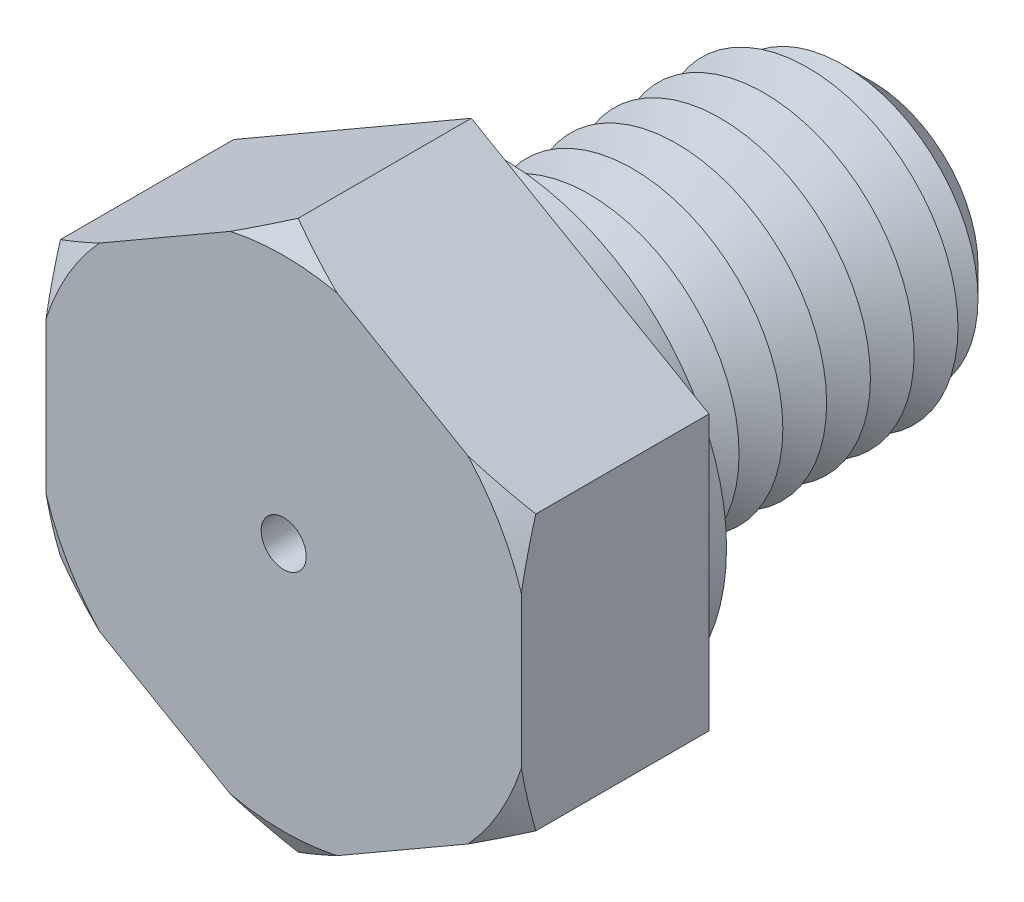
ISO-10303-21;
HEADER;
FILE_DESCRIPTION(('STEP AP214'),'2;1');
FILE_NAME('part.step','',(''),(''),'','','');
FILE_SCHEMA(('AUTOMOTIVE_DESIGN { 1 0 10303 214 1 1 1 1 }'));
ENDSEC;
DATA;
#1=APPLICATION_CONTEXT('core data for automotive mechanical design processes');
#2=APPLICATION_PROTOCOL_DEFINITION('international standard','automotive_design',2000,#1);
#3=PRODUCT_CONTEXT('',#1,'mechanical');
#4=PRODUCT('Part','Part','',(#3));
#5=PRODUCT_RELATED_PRODUCT_CATEGORY('part','',(#4));
#6=PRODUCT_DEFINITION_FORMATION('','',#4);
#7=PRODUCT_DEFINITION_CONTEXT('part definition',#1,'design');
#8=PRODUCT_DEFINITION('design','',#6,#7);
#9=PRODUCT_DEFINITION_SHAPE('','',#8);
#10=(LENGTH_UNIT() NAMED_UNIT(*) SI_UNIT(.MILLI.,.METRE.));
#11=(NAMED_UNIT(*) PLANE_ANGLE_UNIT() SI_UNIT($,.RADIAN.));
#12=(NAMED_UNIT(*) SI_UNIT($,.STERADIAN.) SOLID_ANGLE_UNIT());
#13=UNCERTAINTY_MEASURE_WITH_UNIT(LENGTH_MEASURE(1.E-05),#10,'distance_accuracy_value','');
#14=(GEOMETRIC_REPRESENTATION_CONTEXT(3) GLOBAL_UNCERTAINTY_ASSIGNED_CONTEXT((#13)) GLOBAL_UNIT_ASSIGNED_CONTEXT((#10,
#11,#12)) REPRESENTATION_CONTEXT('',''));
#15=CARTESIAN_POINT('',(0.,0.,0.));
#16=DIRECTION('',(0.,0.,1.));
#17=DIRECTION('',(1.,0.,0.));
#18=AXIS2_PLACEMENT_3D('',#15,#16,#17);
#19=CARTESIAN_POINT('',(9.5,5.48482755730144,7.5));
#20=DIRECTION('',(-0.5,-0.866025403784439,0.));
#21=DIRECTION('',(0.866025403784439,-0.5,0.));
#22=AXIS2_PLACEMENT_3D('',#19,#20,#21);
#23=PLANE('',#22);
#24=CARTESIAN_POINT('',(16.0911028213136,1.67945256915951,3.91531658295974));
#25=CARTESIAN_POINT('',(15.7926530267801,1.85176263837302,4.07633378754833));
#26=CARTESIAN_POINT('',(15.4934885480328,2.02448533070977,4.23561185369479));
#27=CARTESIAN_POINT('',(14.8934288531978,2.37092995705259,4.54987291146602));
#28=CARTESIAN_POINT('',(14.5925334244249,2.54465201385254,4.70485536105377));
#29=CARTESIAN_POINT('',(13.9878148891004,2.89378642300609,5.01015744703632));
#30=CARTESIAN_POINT('',(13.6839854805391,3.06920241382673,5.16046049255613));
#31=CARTESIAN_POINT('',(13.0740489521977,3.4213494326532,5.45475890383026));
#32=CARTESIAN_POINT('',(12.7679419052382,3.59808041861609,5.59875447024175));
#33=CARTESIAN_POINT('',(12.1452865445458,3.95757065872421,5.88261207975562));
#34=CARTESIAN_POINT('',(11.8286703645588,4.14036909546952,6.02227655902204));
#35=CARTESIAN_POINT('',(11.1922429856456,4.50781061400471,6.29164435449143));
#36=CARTESIAN_POINT('',(10.8724316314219,4.69245378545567,6.42134718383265));
#37=CARTESIAN_POINT('',(10.2295404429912,5.06362718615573,6.66831982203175));
#38=CARTESIAN_POINT('',(9.90646410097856,5.25015539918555,6.78560163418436));
#39=CARTESIAN_POINT('',(9.2565183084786,5.62540177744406,7.00502233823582));
#40=CARTESIAN_POINT('',(8.92964935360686,5.81411965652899,7.1071631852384));
#41=CARTESIAN_POINT('',(8.14786487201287,6.26548313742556,7.32807954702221));
#42=CARTESIAN_POINT('',(7.6911273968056,6.52918064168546,7.43861218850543));
#43=CARTESIAN_POINT('',(7.00135730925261,6.92741958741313,7.57140056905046));
#44=CARTESIAN_POINT('',(6.77066782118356,7.06060822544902,7.61016053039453));
#45=CARTESIAN_POINT('',(6.30799755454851,7.3277310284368,7.6757081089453));
#46=CARTESIAN_POINT('',(6.07601678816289,7.46166518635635,7.70249583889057));
#47=CARTESIAN_POINT('',(5.61390562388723,7.72846519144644,7.74308971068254));
#48=CARTESIAN_POINT('',(5.38378495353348,7.86132542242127,7.75704275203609));
#49=CARTESIAN_POINT('',(4.92322735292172,8.1272284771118,7.77208284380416));
#50=CARTESIAN_POINT('',(4.69279042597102,8.26027129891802,7.7731700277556));
#51=CARTESIAN_POINT('',(4.23214422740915,8.52622550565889,7.76244373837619));
#52=CARTESIAN_POINT('',(4.00193495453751,8.65913689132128,7.7506303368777));
#53=CARTESIAN_POINT('',(3.54223236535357,8.92454630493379,7.71446028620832));
#54=CARTESIAN_POINT('',(3.31273916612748,9.05704426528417,7.69010168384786));
#55=CARTESIAN_POINT('',(2.77042202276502,9.37015121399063,7.61833387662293));
#56=CARTESIAN_POINT('',(2.45810922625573,9.55046509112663,7.56573497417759));
#57=CARTESIAN_POINT('',(1.83647686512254,9.90936470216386,7.44074774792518));
#58=CARTESIAN_POINT('',(1.52715774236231,10.087950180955,7.36835654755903));
#59=CARTESIAN_POINT('',(0.911549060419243,10.4433720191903,7.20651778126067));
#60=CARTESIAN_POINT('',(0.605263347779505,10.6202061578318,7.1170509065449));
#61=CARTESIAN_POINT('',(-0.00386858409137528,10.9718886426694,6.92387899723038));
#62=CARTESIAN_POINT('',(-0.30671501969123,11.1467371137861,6.8201748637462));
#63=CARTESIAN_POINT('',(-0.912759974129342,11.496637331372,6.59968787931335));
#64=CARTESIAN_POINT('',(-1.21591973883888,11.6716667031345,6.48276398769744));
#65=CARTESIAN_POINT('',(-1.8190277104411,12.0198712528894,6.23911056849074));
#66=CARTESIAN_POINT('',(-2.11897790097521,12.1930475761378,6.11238754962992));
#67=CARTESIAN_POINT('',(-2.71614501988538,12.5378221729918,5.85087494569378));
#68=CARTESIAN_POINT('',(-3.01336251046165,12.7094207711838,5.71608706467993));
#69=CARTESIAN_POINT('',(-3.60546807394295,13.0512730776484,5.43985672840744));
#70=CARTESIAN_POINT('',(-3.90035610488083,13.2215267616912,5.29841415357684));
#71=CARTESIAN_POINT('',(-4.39671248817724,13.5080982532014,5.05486951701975));
#72=CARTESIAN_POINT('',(-4.59871463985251,13.624724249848,4.95421186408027));
#73=CARTESIAN_POINT('',(-5.00183994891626,13.8574687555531,4.75059724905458));
#74=CARTESIAN_POINT('',(-5.20296313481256,13.9735872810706,4.647640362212));
#75=CARTESIAN_POINT('',(-5.60231741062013,14.2041545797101,4.44078592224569));
#76=CARTESIAN_POINT('',(-5.80055672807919,14.3186081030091,4.33690951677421));
#77=CARTESIAN_POINT('',(-6.19633679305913,14.5471118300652,4.12738601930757));
#78=CARTESIAN_POINT('',(-6.39387752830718,14.6611620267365,4.02173889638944));
#79=CARTESIAN_POINT('',(-6.59110282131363,14.7750301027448,3.91531658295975));
#80=B_SPLINE_CURVE_WITH_KNOTS('',3,(#24,#25,#26,#27,#28,#29,#30,#31,#32,#33,#34,#35,#36,#37,#38,
#39,#40,#41,#42,#43,#44,#45,#46,#47,#48,#49,#50,#51,#52,#53,#54,#55,#56,#57,#58,#59,#60,#61,#62,
#63,#64,#65,#66,#67,#68,#69,#70,#71,#72,#73,#74,#75,#76,#77,#78,#79),.UNSPECIFIED.,.F.,.F.,(4,2,
2,2,2,2,2,2,2,2,2,2,2,2,2,2,2,2,2,2,2,2,2,2,2,2,2,4),(0.,1.14115474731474,2.28245284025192,
3.42741980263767,4.57235031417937,5.74632926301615,6.92036555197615,8.09325673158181,
9.26599632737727,10.8807998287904,11.6881240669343,12.4954407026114,13.2933978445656,
14.0913467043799,14.8892911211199,15.6873598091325,16.7800286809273,17.8728564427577,
18.9669273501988,20.0609290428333,21.1679585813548,22.2742590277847,23.380326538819,
24.4864139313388,25.2485345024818,26.010630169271,26.7647435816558,27.5188701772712),.UNSPECIFIED.);
#81=CARTESIAN_POINT('',(9.5,5.48482755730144,6.92264973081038));
#82=VERTEX_POINT('',#81);
#83=CARTESIAN_POINT('',(7.36878164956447,6.71528704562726,7.5));
#84=VERTEX_POINT('',#83);
#85=EDGE_CURVE('E132',#82,#84,#80,.T.);
#86=ORIENTED_EDGE('',*,*,#85,.F.);
#87=DIRECTION('',(0.,0.,-1.));
#88=VECTOR('',#87,1.);
#89=CARTESIAN_POINT('',(9.5,5.48482755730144,7.5));
#90=LINE('',#89,#88);
#91=CARTESIAN_POINT('',(9.5,5.48482755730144,0.));
#92=VERTEX_POINT('',#91);
#93=EDGE_CURVE('E144',#82,#92,#90,.T.);
#94=ORIENTED_EDGE('',*,*,#93,.T.);
#95=DIRECTION('',(-0.866025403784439,0.5,0.));
#96=VECTOR('',#95,1.);
#97=CARTESIAN_POINT('',(9.5,5.48482755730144,0.));
#98=LINE('',#97,#96);
#99=CARTESIAN_POINT('',(0.,10.9696551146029,0.));
#100=VERTEX_POINT('',#99);
#101=EDGE_CURVE('E265',#92,#100,#98,.T.);
#102=ORIENTED_EDGE('',*,*,#101,.T.);
#103=DIRECTION('',(0.,0.,-1.));
#104=VECTOR('',#103,1.);
#105=CARTESIAN_POINT('',(0.,10.9696551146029,7.5));
#106=LINE('',#105,#104);
#107=CARTESIAN_POINT('',(0.,10.9696551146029,6.92264973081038));
#108=VERTEX_POINT('',#107);
#109=EDGE_CURVE('E179',#108,#100,#106,.T.);
#110=ORIENTED_EDGE('',*,*,#109,.F.);
#111=CARTESIAN_POINT('',(2.13121835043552,9.73919562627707,7.5));
#112=VERTEX_POINT('',#111);
#113=EDGE_CURVE('E151',#112,#108,#80,.T.);
#114=ORIENTED_EDGE('',*,*,#113,.F.);
#115=DIRECTION('',(-0.866025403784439,0.5,0.));
#116=VECTOR('',#115,1.);
#117=CARTESIAN_POINT('',(9.5,5.48482755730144,7.5));
#118=LINE('',#117,#116);
#119=EDGE_CURVE('E148',#84,#112,#118,.T.);
#120=ORIENTED_EDGE('',*,*,#119,.F.);
#121=EDGE_LOOP('',(#86,#94,#102,#110,#114,#120));
#122=FACE_BOUND('',#121,.T.);
#123=ADVANCED_FACE('F39',(#122),#23,.F.);
#124=CARTESIAN_POINT('',(0.,10.9696551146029,7.5));
#125=DIRECTION('',(0.5,-0.866025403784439,0.));
#126=DIRECTION('',(0.866025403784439,0.5,0.));
#127=AXIS2_PLACEMENT_3D('',#124,#125,#126);
#128=PLANE('',#127);
#129=CARTESIAN_POINT('',(6.59110282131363,14.7750301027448,3.91531658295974));
#130=CARTESIAN_POINT('',(6.29265302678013,14.6027200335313,4.07633378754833));
#131=CARTESIAN_POINT('',(5.99348854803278,14.4299973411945,4.23561185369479));
#132=CARTESIAN_POINT('',(5.3934288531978,14.0835527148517,4.54987291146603));
#133=CARTESIAN_POINT('',(5.09253342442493,13.9098306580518,4.70485536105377));
#134=CARTESIAN_POINT('',(4.48781488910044,13.5606962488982,5.01015744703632));
#135=CARTESIAN_POINT('',(4.18398548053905,13.3852802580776,5.16046049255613));
#136=CARTESIAN_POINT('',(3.5740489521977,13.0331332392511,5.45475890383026));
#137=CARTESIAN_POINT('',(3.26794190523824,12.8564022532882,5.59875447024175));
#138=CARTESIAN_POINT('',(2.64528654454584,12.4969120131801,5.88261207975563));
#139=CARTESIAN_POINT('',(2.32867036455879,12.3141135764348,6.02227655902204));
#140=CARTESIAN_POINT('',(1.69224298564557,11.9466720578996,6.29164435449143));
#141=CARTESIAN_POINT('',(1.37243163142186,11.7620288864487,6.42134718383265));
#142=CARTESIAN_POINT('',(0.729540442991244,11.3908554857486,6.66831982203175));
#143=CARTESIAN_POINT('',(0.406464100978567,11.2043272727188,6.78560163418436));
#144=CARTESIAN_POINT('',(-0.243481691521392,10.8290808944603,7.00502233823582));
#145=CARTESIAN_POINT('',(-0.570350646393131,10.6403630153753,7.1071631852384));
#146=CARTESIAN_POINT('',(-1.35213512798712,10.1889995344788,7.32807954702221));
#147=CARTESIAN_POINT('',(-1.80887260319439,9.92530203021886,7.43861218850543));
#148=CARTESIAN_POINT('',(-2.49864269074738,9.52706308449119,7.57140056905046));
#149=CARTESIAN_POINT('',(-2.72933217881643,9.39387444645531,7.61016053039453));
#150=CARTESIAN_POINT('',(-3.19200244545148,9.12675164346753,7.6757081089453));
#151=CARTESIAN_POINT('',(-3.4239832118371,8.99281748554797,7.70249583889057));
#152=CARTESIAN_POINT('',(-3.88609437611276,8.72601748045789,7.74308971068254));
#153=CARTESIAN_POINT('',(-4.11621504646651,8.59315724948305,7.75704275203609));
#154=CARTESIAN_POINT('',(-4.57677264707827,8.32725419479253,7.77208284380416));
#155=CARTESIAN_POINT('',(-4.80720957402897,8.19421137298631,7.7731700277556));
#156=CARTESIAN_POINT('',(-5.26785577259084,7.92825716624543,7.76244373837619));
#157=CARTESIAN_POINT('',(-5.49806504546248,7.79534578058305,7.7506303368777));
#158=CARTESIAN_POINT('',(-5.95776763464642,7.52993636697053,7.71446028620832));
#159=CARTESIAN_POINT('',(-6.18726083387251,7.39743840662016,7.69010168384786));
#160=CARTESIAN_POINT('',(-6.72957797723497,7.0843314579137,7.61833387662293));
#161=CARTESIAN_POINT('',(-7.04189077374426,6.90401758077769,7.56573497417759));
#162=CARTESIAN_POINT('',(-7.66352313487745,6.54511796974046,7.44074774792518));
#163=CARTESIAN_POINT('',(-7.97284225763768,6.36653249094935,7.36835654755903));
#164=CARTESIAN_POINT('',(-8.58845093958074,6.01111065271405,7.20651778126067));
#165=CARTESIAN_POINT('',(-8.89473665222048,5.83427651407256,7.1170509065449));
#166=CARTESIAN_POINT('',(-9.50386858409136,5.48259402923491,6.92387899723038));
#167=CARTESIAN_POINT('',(-9.80671501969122,5.30774555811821,6.8201748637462));
#168=CARTESIAN_POINT('',(-10.4127599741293,4.95784534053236,6.59968787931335));
#169=CARTESIAN_POINT('',(-10.7159197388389,4.78281596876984,6.48276398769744));
#170=CARTESIAN_POINT('',(-11.3190277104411,4.43461141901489,6.23911056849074));
#171=CARTESIAN_POINT('',(-11.6189779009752,4.26143509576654,6.11238754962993));
#172=CARTESIAN_POINT('',(-12.2161450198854,3.91666049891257,5.85087494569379));
#173=CARTESIAN_POINT('',(-12.5133625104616,3.74506190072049,5.71608706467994));
#174=CARTESIAN_POINT('',(-13.1054680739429,3.40320959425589,5.43985672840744));
#175=CARTESIAN_POINT('',(-13.4003561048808,3.2329559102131,5.29841415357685));
#176=CARTESIAN_POINT('',(-13.8967124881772,2.94638441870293,5.05486951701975));
#177=CARTESIAN_POINT('',(-14.0987146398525,2.82975842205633,4.95421186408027));
#178=CARTESIAN_POINT('',(-14.5018399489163,2.59701391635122,4.75059724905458));
#179=CARTESIAN_POINT('',(-14.7029631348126,2.48089539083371,4.647640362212));
#180=CARTESIAN_POINT('',(-15.1023174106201,2.25032809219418,4.44078592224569));
#181=CARTESIAN_POINT('',(-15.3005567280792,2.13587456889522,4.33690951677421));
#182=CARTESIAN_POINT('',(-15.6963367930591,1.90737084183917,4.12738601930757));
#183=CARTESIAN_POINT('',(-15.8938775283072,1.79332064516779,4.02173889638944));
#184=CARTESIAN_POINT('',(-16.0911028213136,1.67945256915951,3.91531658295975));
#185=B_SPLINE_CURVE_WITH_KNOTS('',3,(#129,#130,#131,#132,#133,#134,#135,#136,#137,#138,#139,
#140,#141,#142,#143,#144,#145,#146,#147,#148,#149,#150,#151,#152,#153,#154,#155,#156,#157,#158,
#159,#160,#161,#162,#163,#164,#165,#166,#167,#168,#169,#170,#171,#172,#173,#174,#175,#176,#177,
#178,#179,#180,#181,#182,#183,#184),.UNSPECIFIED.,.F.,.F.,(4,2,2,2,2,2,2,2,2,2,2,2,2,2,2,2,2,2,
2,2,2,2,2,2,2,2,2,4),(0.,1.14115474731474,2.28245284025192,3.42741980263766,4.57235031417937,
5.74632926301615,6.92036555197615,8.09325673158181,9.26599632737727,10.8807998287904,
11.6881240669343,12.4954407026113,13.2933978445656,14.0913467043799,14.8892911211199,
15.6873598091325,16.7800286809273,17.8728564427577,18.9669273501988,20.0609290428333,
21.1679585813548,22.2742590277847,23.380326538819,24.4864139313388,25.2485345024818,
26.010630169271,26.7647435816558,27.5188701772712),.UNSPECIFIED.);
#186=CARTESIAN_POINT('',(-2.13121835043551,9.73919562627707,7.5));
#187=VERTEX_POINT('',#186);
#188=EDGE_CURVE('E744',#108,#187,#185,.T.);
#189=ORIENTED_EDGE('',*,*,#188,.F.);
#190=ORIENTED_EDGE('',*,*,#109,.T.);
#191=DIRECTION('',(-0.866025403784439,-0.5,0.));
#192=VECTOR('',#191,1.);
#193=CARTESIAN_POINT('',(0.,10.9696551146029,0.));
#194=LINE('',#193,#192);
#195=CARTESIAN_POINT('',(-9.5,5.48482755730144,0.));
#196=VERTEX_POINT('',#195);
#197=EDGE_CURVE('E285',#100,#196,#194,.T.);
#198=ORIENTED_EDGE('',*,*,#197,.T.);
#199=DIRECTION('',(0.,0.,-1.));
#200=VECTOR('',#199,1.);
#201=CARTESIAN_POINT('',(-9.5,5.48482755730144,7.5));
#202=LINE('',#201,#200);
#203=CARTESIAN_POINT('',(-9.5,5.48482755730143,6.92264973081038));
#204=VERTEX_POINT('',#203);
#205=EDGE_CURVE('E176',#204,#196,#202,.T.);
#206=ORIENTED_EDGE('',*,*,#205,.F.);
#207=CARTESIAN_POINT('',(-7.36878164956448,6.71528704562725,7.5));
#208=VERTEX_POINT('',#207);
#209=EDGE_CURVE('E312',#208,#204,#185,.T.);
#210=ORIENTED_EDGE('',*,*,#209,.F.);
#211=DIRECTION('',(-0.866025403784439,-0.5,0.));
#212=VECTOR('',#211,1.);
#213=CARTESIAN_POINT('',(0.,10.9696551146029,7.5));
#214=LINE('',#213,#212);
#215=EDGE_CURVE('E268',#187,#208,#214,.T.);
#216=ORIENTED_EDGE('',*,*,#215,.F.);
#217=EDGE_LOOP('',(#189,#190,#198,#206,#210,#216));
#218=FACE_BOUND('',#217,.T.);
#219=ADVANCED_FACE('F381',(#218),#128,.F.);
#220=CARTESIAN_POINT('',(-9.5,5.48482755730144,7.5));
#221=DIRECTION('',(1.,0.,0.));
#222=DIRECTION('',(0.,1.,0.));
#223=AXIS2_PLACEMENT_3D('',#220,#221,#222);
#224=PLANE('',#223);
#225=CARTESIAN_POINT('',(-9.5,12.0759303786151,4.38509256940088));
#226=CARTESIAN_POINT('',(-9.5,11.7327439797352,4.5407773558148));
#227=CARTESIAN_POINT('',(-9.5,11.388618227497,4.69443095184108));
#228=CARTESIAN_POINT('',(-9.5,10.698085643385,4.99669009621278));
#229=CARTESIAN_POINT('',(-9.5,10.3516784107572,5.1452947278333));
#230=CARTESIAN_POINT('',(-9.5,9.65484997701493,5.43702212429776));
#231=CARTESIAN_POINT('',(-9.5,9.30441804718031,5.58011936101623));
#232=CARTESIAN_POINT('',(-9.5,8.60059023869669,5.85880989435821));
#233=CARTESIAN_POINT('',(-9.5,8.24719449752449,5.9944035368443));
#234=CARTESIAN_POINT('',(-9.5,7.53860340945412,6.25582574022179));
#235=CARTESIAN_POINT('',(-9.5,7.18342337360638,6.38169559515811));
#236=CARTESIAN_POINT('',(-9.5,6.46926569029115,6.62229858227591));
#237=CARTESIAN_POINT('',(-9.5,6.11028785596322,6.73703116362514));
#238=CARTESIAN_POINT('',(-9.5,5.38872372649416,6.95272419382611));
#239=CARTESIAN_POINT('',(-9.5,5.02614305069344,7.05370330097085));
#240=CARTESIAN_POINT('',(-9.5,4.29675196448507,7.23920160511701));
#241=CARTESIAN_POINT('',(-9.5,3.92994173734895,7.32372151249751));
#242=CARTESIAN_POINT('',(-9.5,3.29665308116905,7.45205940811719));
#243=CARTESIAN_POINT('',(-9.5,3.03113701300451,7.50062833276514));
#244=CARTESIAN_POINT('',(-9.5,2.49832809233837,7.5865841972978));
#245=CARTESIAN_POINT('',(-9.5,2.23103554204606,7.62397299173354));
#246=CARTESIAN_POINT('',(-9.5,1.69506861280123,7.68659004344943));
#247=CARTESIAN_POINT('',(-9.5,1.42639449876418,7.71182055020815));
#248=CARTESIAN_POINT('',(-9.5,0.888138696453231,7.74939803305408));
#249=CARTESIAN_POINT('',(-9.5,0.618557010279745,7.76174503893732));
#250=CARTESIAN_POINT('',(-9.5,0.0792458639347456,7.77317034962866));
#251=CARTESIAN_POINT('',(-9.5,-0.190483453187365,7.77225534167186));
#252=CARTESIAN_POINT('',(-9.5,-0.729567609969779,7.75720205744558));
#253=CARTESIAN_POINT('',(-9.5,-0.998922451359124,7.74306384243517));
#254=CARTESIAN_POINT('',(-9.5,-1.53667618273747,7.70199575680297));
#255=CARTESIAN_POINT('',(-9.5,-1.80507496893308,7.67506453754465));
#256=CARTESIAN_POINT('',(-9.5,-2.34038611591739,7.60918517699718));
#257=CARTESIAN_POINT('',(-9.5,-2.60729841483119,7.57023653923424));
#258=CARTESIAN_POINT('',(-9.5,-3.27166409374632,7.45918941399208));
#259=CARTESIAN_POINT('',(-9.5,-3.66797754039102,7.38023980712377));
#260=CARTESIAN_POINT('',(-9.5,-4.45585575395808,7.20141943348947));
#261=CARTESIAN_POINT('',(-9.5,-4.8474194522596,7.10154404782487));
#262=CARTESIAN_POINT('',(-9.5,-5.6265713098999,6.88438943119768));
#263=CARTESIAN_POINT('',(-9.5,-6.01414884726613,6.76707245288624));
#264=CARTESIAN_POINT('',(-9.5,-6.78474185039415,6.51851091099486));
#265=CARTESIAN_POINT('',(-9.5,-7.16775763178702,6.38726731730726));
#266=CARTESIAN_POINT('',(-9.5,-7.93407213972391,6.11202298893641));
#267=CARTESIAN_POINT('',(-9.5,-8.31732458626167,5.96789419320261));
#268=CARTESIAN_POINT('',(-9.5,-9.08024927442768,5.67043108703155));
#269=CARTESIAN_POINT('',(-9.5,-9.4599212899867,5.51709619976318));
#270=CARTESIAN_POINT('',(-9.5,-10.2138362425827,5.20397874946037));
#271=CARTESIAN_POINT('',(-9.5,-10.5880982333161,5.04424191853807));
#272=CARTESIAN_POINT('',(-9.5,-11.1474871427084,4.80018423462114));
#273=CARTESIAN_POINT('',(-9.5,-11.3335947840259,4.71809930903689));
#274=CARTESIAN_POINT('',(-9.5,-11.7052038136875,4.55257683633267));
#275=CARTESIAN_POINT('',(-9.5,-11.8907052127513,4.46913931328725));
#276=CARTESIAN_POINT('',(-9.5,-12.0759303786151,4.38509256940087));
#277=B_SPLINE_CURVE_WITH_KNOTS('',3,(#225,#226,#227,#228,#229,#230,#231,#232,#233,#234,#235,
#236,#237,#238,#239,#240,#241,#242,#243,#244,#245,#246,#247,#248,#249,#250,#251,#252,#253,#254,
#255,#256,#257,#258,#259,#260,#261,#262,#263,#264,#265,#266,#267,#268,#269,#270,#271,#272,#273,
#274,#275,#276),.UNSPECIFIED.,.F.,.F.,(4,2,2,2,2,2,2,2,2,2,2,2,2,2,2,2,2,2,2,2,2,2,2,2,2,4),(0.,
1.13056270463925,2.26132959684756,3.39682602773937,4.53227007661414,5.66259174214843,
6.79296928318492,7.92179771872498,9.0505774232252,9.86013572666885,10.6695596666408,
11.4788337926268,12.288106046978,13.0969702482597,13.9058307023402,14.7147764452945,
15.5237556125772,16.7353316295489,17.9471753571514,19.1616810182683,20.3761021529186,
21.6043286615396,22.8326322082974,24.0533405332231,24.6635541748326,25.273756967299),.UNSPECIFIED.);
#278=CARTESIAN_POINT('',(-9.5,3.02390858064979,7.5));
#279=VERTEX_POINT('',#278);
#280=EDGE_CURVE('E311',#204,#279,#277,.T.);
#281=ORIENTED_EDGE('',*,*,#280,.F.);
#282=ORIENTED_EDGE('',*,*,#205,.T.);
#283=DIRECTION('',(0.,-1.,0.));
#284=VECTOR('',#283,1.);
#285=CARTESIAN_POINT('',(-9.5,5.48482755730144,0.));
#286=LINE('',#285,#284);
#287=CARTESIAN_POINT('',(-9.5,-5.48482755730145,0.));
#288=VERTEX_POINT('',#287);
#289=EDGE_CURVE('E289',#196,#288,#286,.T.);
#290=ORIENTED_EDGE('',*,*,#289,.T.);
#291=DIRECTION('',(0.,0.,-1.));
#292=VECTOR('',#291,1.);
#293=CARTESIAN_POINT('',(-9.5,-5.48482755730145,7.5));
#294=LINE('',#293,#292);
#295=CARTESIAN_POINT('',(-9.49999999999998,-5.48482755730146,6.92264973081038));
#296=VERTEX_POINT('',#295);
#297=EDGE_CURVE('E173',#296,#288,#294,.T.);
#298=ORIENTED_EDGE('',*,*,#297,.F.);
#299=CARTESIAN_POINT('',(-9.5,-3.02390858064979,7.5));
#300=VERTEX_POINT('',#299);
#301=EDGE_CURVE('E313',#300,#296,#277,.T.);
#302=ORIENTED_EDGE('',*,*,#301,.F.);
#303=DIRECTION('',(0.,-1.,0.));
#304=VECTOR('',#303,1.);
#305=CARTESIAN_POINT('',(-9.5,5.48482755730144,7.5));
#306=LINE('',#305,#304);
#307=EDGE_CURVE('E272',#279,#300,#306,.T.);
#308=ORIENTED_EDGE('',*,*,#307,.F.);
#309=EDGE_LOOP('',(#281,#282,#290,#298,#302,#308));
#310=FACE_BOUND('',#309,.T.);
#311=ADVANCED_FACE('F377',(#310),#224,.F.);
#312=CARTESIAN_POINT('',(-9.5,-5.48482755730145,7.5));
#313=DIRECTION('',(0.5,0.866025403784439,0.));
#314=DIRECTION('',(-0.866025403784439,0.5,0.));
#315=AXIS2_PLACEMENT_3D('',#312,#313,#314);
#316=PLANE('',#315);
#317=CARTESIAN_POINT('',(-16.0911028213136,-1.67945256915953,3.91531658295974));
#318=CARTESIAN_POINT('',(-15.7926530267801,-1.85176263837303,4.07633378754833));
#319=CARTESIAN_POINT('',(-15.4934885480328,-2.02448533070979,4.23561185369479));
#320=CARTESIAN_POINT('',(-14.8934288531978,-2.37092995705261,4.54987291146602));
#321=CARTESIAN_POINT('',(-14.5925334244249,-2.54465201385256,4.70485536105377));
#322=CARTESIAN_POINT('',(-13.9878148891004,-2.89378642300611,5.01015744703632));
#323=CARTESIAN_POINT('',(-13.683985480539,-3.06920241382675,5.16046049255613));
#324=CARTESIAN_POINT('',(-13.0740489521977,-3.42134943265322,5.45475890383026));
#325=CARTESIAN_POINT('',(-12.7679419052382,-3.5980804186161,5.59875447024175));
#326=CARTESIAN_POINT('',(-12.1452865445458,-3.95757065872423,5.88261207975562));
#327=CARTESIAN_POINT('',(-11.8286703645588,-4.14036909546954,6.02227655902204));
#328=CARTESIAN_POINT('',(-11.1922429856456,-4.50781061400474,6.29164435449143));
#329=CARTESIAN_POINT('',(-10.8724316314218,-4.69245378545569,6.42134718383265));
#330=CARTESIAN_POINT('',(-10.2295404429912,-5.06362718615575,6.66831982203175));
#331=CARTESIAN_POINT('',(-9.90646410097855,-5.25015539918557,6.78560163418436));
#332=CARTESIAN_POINT('',(-9.25651830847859,-5.62540177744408,7.00502233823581));
#333=CARTESIAN_POINT('',(-8.92964935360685,-5.81411965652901,7.1071631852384));
#334=CARTESIAN_POINT('',(-8.14786487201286,-6.26548313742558,7.32807954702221));
#335=CARTESIAN_POINT('',(-7.69112739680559,-6.52918064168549,7.43861218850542));
#336=CARTESIAN_POINT('',(-7.0013573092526,-6.92741958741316,7.57140056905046));
#337=CARTESIAN_POINT('',(-6.77066782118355,-7.06060822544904,7.61016053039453));
#338=CARTESIAN_POINT('',(-6.3079975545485,-7.32773102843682,7.6757081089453));
#339=CARTESIAN_POINT('',(-6.07601678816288,-7.46166518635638,7.70249583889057));
#340=CARTESIAN_POINT('',(-5.61390562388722,-7.72846519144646,7.74308971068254));
#341=CARTESIAN_POINT('',(-5.38378495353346,-7.8613254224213,7.75704275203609));
#342=CARTESIAN_POINT('',(-4.9232273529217,-8.12722847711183,7.77208284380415));
#343=CARTESIAN_POINT('',(-4.692790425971,-8.26027129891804,7.77317002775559));
#344=CARTESIAN_POINT('',(-4.23214422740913,-8.52622550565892,7.76244373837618));
#345=CARTESIAN_POINT('',(-4.00193495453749,-8.6591368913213,7.75063033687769));
#346=CARTESIAN_POINT('',(-3.54223236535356,-8.92454630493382,7.71446028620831));
#347=CARTESIAN_POINT('',(-3.31273916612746,-9.05704426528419,7.69010168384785));
#348=CARTESIAN_POINT('',(-2.770422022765,-9.37015121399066,7.61833387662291));
#349=CARTESIAN_POINT('',(-2.45810922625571,-9.55046509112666,7.56573497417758));
#350=CARTESIAN_POINT('',(-1.83647686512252,-9.9093647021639,7.44074774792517));
#351=CARTESIAN_POINT('',(-1.52715774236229,-10.087950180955,7.36835654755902));
#352=CARTESIAN_POINT('',(-0.911549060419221,-10.4433720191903,7.20651778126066));
#353=CARTESIAN_POINT('',(-0.605263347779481,-10.6202061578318,7.11705090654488));
#354=CARTESIAN_POINT('',(0.00386858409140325,-10.9718886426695,6.92387899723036));
#355=CARTESIAN_POINT('',(0.30671501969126,-11.1467371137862,6.82017486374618));
#356=CARTESIAN_POINT('',(0.912759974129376,-11.496637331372,6.59968787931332));
#357=CARTESIAN_POINT('',(1.21591973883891,-11.6716667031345,6.48276398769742));
#358=CARTESIAN_POINT('',(1.81902771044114,-12.0198712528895,6.23911056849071));
#359=CARTESIAN_POINT('',(2.11897790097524,-12.1930475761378,6.11238754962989));
#360=CARTESIAN_POINT('',(2.71614501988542,-12.5378221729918,5.85087494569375));
#361=CARTESIAN_POINT('',(3.01336251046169,-12.7094207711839,5.7160870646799));
#362=CARTESIAN_POINT('',(3.60546807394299,-13.0512730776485,5.4398567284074));
#363=CARTESIAN_POINT('',(3.90035610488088,-13.2215267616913,5.29841415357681));
#364=CARTESIAN_POINT('',(4.39671248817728,-13.5080982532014,5.05486951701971));
#365=CARTESIAN_POINT('',(4.59871463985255,-13.624724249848,4.95421186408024));
#366=CARTESIAN_POINT('',(5.00183994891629,-13.8574687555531,4.75059724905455));
#367=CARTESIAN_POINT('',(5.20296313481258,-13.9735872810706,4.64764036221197));
#368=CARTESIAN_POINT('',(5.60231741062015,-14.2041545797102,4.44078592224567));
#369=CARTESIAN_POINT('',(5.8005567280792,-14.3186081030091,4.33690951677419));
#370=CARTESIAN_POINT('',(6.19633679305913,-14.5471118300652,4.12738601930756));
#371=CARTESIAN_POINT('',(6.39387752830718,-14.6611620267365,4.02173889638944));
#372=CARTESIAN_POINT('',(6.59110282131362,-14.7750301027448,3.91531658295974));
#373=B_SPLINE_CURVE_WITH_KNOTS('',3,(#317,#318,#319,#320,#321,#322,#323,#324,#325,#326,#327,
#328,#329,#330,#331,#332,#333,#334,#335,#336,#337,#338,#339,#340,#341,#342,#343,#344,#345,#346,
#347,#348,#349,#350,#351,#352,#353,#354,#355,#356,#357,#358,#359,#360,#361,#362,#363,#364,#365,
#366,#367,#368,#369,#370,#371,#372),.UNSPECIFIED.,.F.,.F.,(4,2,2,2,2,2,2,2,2,2,2,2,2,2,2,2,2,2,
2,2,2,2,2,2,2,2,2,4),(0.,1.14115474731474,2.28245284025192,3.42741980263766,4.57235031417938,
5.74632926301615,6.92036555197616,8.09325673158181,9.26599632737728,10.8807998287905,
11.6881240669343,12.4954407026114,13.2933978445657,14.0913467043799,14.8892911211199,
15.6873598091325,16.7800286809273,17.8728564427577,18.9669273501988,20.0609290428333,
21.1679585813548,22.2742590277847,23.3803265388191,24.4864139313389,25.2485345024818,
26.010630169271,26.7647435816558,27.5188701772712),.UNSPECIFIED.);
#374=CARTESIAN_POINT('',(-7.36878164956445,-6.71528704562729,7.5));
#375=VERTEX_POINT('',#374);
#376=EDGE_CURVE('E316',#296,#375,#373,.T.);
#377=ORIENTED_EDGE('',*,*,#376,.F.);
#378=ORIENTED_EDGE('',*,*,#297,.T.);
#379=DIRECTION('',(0.866025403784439,-0.5,0.));
#380=VECTOR('',#379,1.);
#381=CARTESIAN_POINT('',(-9.5,-5.48482755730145,0.));
#382=LINE('',#381,#380);
#383=CARTESIAN_POINT('',(0.,-10.9696551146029,0.));
#384=VERTEX_POINT('',#383);
#385=EDGE_CURVE('E293',#288,#384,#382,.T.);
#386=ORIENTED_EDGE('',*,*,#385,.T.);
#387=DIRECTION('',(0.,0.,-1.));
#388=VECTOR('',#387,1.);
#389=CARTESIAN_POINT('',(0.,-10.9696551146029,7.5));
#390=LINE('',#389,#388);
#391=CARTESIAN_POINT('',(0.,-10.9696551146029,6.92264973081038));
#392=VERTEX_POINT('',#391);
#393=EDGE_CURVE('E163',#392,#384,#390,.T.);
#394=ORIENTED_EDGE('',*,*,#393,.F.);
#395=CARTESIAN_POINT('',(-2.13121835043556,-9.73919562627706,7.5));
#396=VERTEX_POINT('',#395);
#397=EDGE_CURVE('E304',#396,#392,#373,.T.);
#398=ORIENTED_EDGE('',*,*,#397,.F.);
#399=DIRECTION('',(0.866025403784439,-0.5,0.));
#400=VECTOR('',#399,1.);
#401=CARTESIAN_POINT('',(-9.5,-5.48482755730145,7.5));
#402=LINE('',#401,#400);
#403=EDGE_CURVE('E276',#375,#396,#402,.T.);
#404=ORIENTED_EDGE('',*,*,#403,.F.);
#405=EDGE_LOOP('',(#377,#378,#386,#394,#398,#404));
#406=FACE_BOUND('',#405,.T.);
#407=ADVANCED_FACE('F380',(#406),#316,.F.);
#408=CARTESIAN_POINT('',(0.,-10.9696551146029,7.5));
#409=DIRECTION('',(-0.5,0.866025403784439,0.));
#410=DIRECTION('',(-0.866025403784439,-0.5,0.));
#411=AXIS2_PLACEMENT_3D('',#408,#409,#410);
#412=PLANE('',#411);
#413=CARTESIAN_POINT('',(-6.59110282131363,-14.7750301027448,3.91531658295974));
#414=CARTESIAN_POINT('',(-6.29265302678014,-14.6027200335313,4.07633378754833));
#415=CARTESIAN_POINT('',(-5.99348854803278,-14.4299973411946,4.23561185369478));
#416=CARTESIAN_POINT('',(-5.3934288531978,-14.0835527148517,4.54987291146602));
#417=CARTESIAN_POINT('',(-5.09253342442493,-13.9098306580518,4.70485536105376));
#418=CARTESIAN_POINT('',(-4.48781488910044,-13.5606962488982,5.01015744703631));
#419=CARTESIAN_POINT('',(-4.18398548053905,-13.3852802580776,5.16046049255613));
#420=CARTESIAN_POINT('',(-3.5740489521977,-13.0331332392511,5.45475890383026));
#421=CARTESIAN_POINT('',(-3.26794190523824,-12.8564022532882,5.59875447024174));
#422=CARTESIAN_POINT('',(-2.64528654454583,-12.4969120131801,5.88261207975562));
#423=CARTESIAN_POINT('',(-2.32867036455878,-12.3141135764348,6.02227655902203));
#424=CARTESIAN_POINT('',(-1.69224298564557,-11.9466720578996,6.29164435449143));
#425=CARTESIAN_POINT('',(-1.37243163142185,-11.7620288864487,6.42134718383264));
#426=CARTESIAN_POINT('',(-0.729540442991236,-11.3908554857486,6.66831982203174));
#427=CARTESIAN_POINT('',(-0.406464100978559,-11.2043272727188,6.78560163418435));
#428=CARTESIAN_POINT('',(0.243481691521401,-10.8290808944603,7.00502233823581));
#429=CARTESIAN_POINT('',(0.570350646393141,-10.6403630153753,7.10716318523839));
#430=CARTESIAN_POINT('',(1.35213512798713,-10.1889995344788,7.3280795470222));
#431=CARTESIAN_POINT('',(1.8088726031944,-9.92530203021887,7.43861218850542));
#432=CARTESIAN_POINT('',(2.49864269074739,-9.5270630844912,7.57140056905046));
#433=CARTESIAN_POINT('',(2.72933217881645,-9.39387444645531,7.61016053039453));
#434=CARTESIAN_POINT('',(3.19200244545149,-9.12675164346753,7.6757081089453));
#435=CARTESIAN_POINT('',(3.42398321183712,-8.99281748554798,7.70249583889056));
#436=CARTESIAN_POINT('',(3.88609437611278,-8.72601748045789,7.74308971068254));
#437=CARTESIAN_POINT('',(4.11621504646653,-8.59315724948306,7.75704275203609));
#438=CARTESIAN_POINT('',(4.57677264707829,-8.32725419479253,7.77208284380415));
#439=CARTESIAN_POINT('',(4.80720957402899,-8.19421137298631,7.77317002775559));
#440=CARTESIAN_POINT('',(5.26785577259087,-7.92825716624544,7.76244373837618));
#441=CARTESIAN_POINT('',(5.4980650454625,-7.79534578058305,7.75063033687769));
#442=CARTESIAN_POINT('',(5.95776763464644,-7.52993636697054,7.71446028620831));
#443=CARTESIAN_POINT('',(6.18726083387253,-7.39743840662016,7.69010168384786));
#444=CARTESIAN_POINT('',(6.72957797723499,-7.0843314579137,7.61833387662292));
#445=CARTESIAN_POINT('',(7.04189077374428,-6.9040175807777,7.56573497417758));
#446=CARTESIAN_POINT('',(7.66352313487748,-6.54511796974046,7.44074774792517));
#447=CARTESIAN_POINT('',(7.97284225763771,-6.36653249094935,7.36835654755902));
#448=CARTESIAN_POINT('',(8.58845093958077,-6.01111065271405,7.20651778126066));
#449=CARTESIAN_POINT('',(8.89473665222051,-5.83427651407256,7.11705090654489));
#450=CARTESIAN_POINT('',(9.50386858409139,-5.48259402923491,6.92387899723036));
#451=CARTESIAN_POINT('',(9.80671501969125,-5.30774555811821,6.82017486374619));
#452=CARTESIAN_POINT('',(10.4127599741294,-4.95784534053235,6.59968787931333));
#453=CARTESIAN_POINT('',(10.7159197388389,-4.78281596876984,6.48276398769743));
#454=CARTESIAN_POINT('',(11.3190277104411,-4.43461141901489,6.23911056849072));
#455=CARTESIAN_POINT('',(11.6189779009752,-4.26143509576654,6.1123875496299));
#456=CARTESIAN_POINT('',(12.2161450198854,-3.91666049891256,5.85087494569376));
#457=CARTESIAN_POINT('',(12.5133625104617,-3.74506190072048,5.71608706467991));
#458=CARTESIAN_POINT('',(13.105468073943,-3.40320959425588,5.43985672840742));
#459=CARTESIAN_POINT('',(13.4003561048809,-3.23295591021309,5.29841415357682));
#460=CARTESIAN_POINT('',(13.8967124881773,-2.94638441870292,5.05486951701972));
#461=CARTESIAN_POINT('',(14.0987146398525,-2.82975842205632,4.95421186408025));
#462=CARTESIAN_POINT('',(14.5018399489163,-2.59701391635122,4.75059724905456));
#463=CARTESIAN_POINT('',(14.7029631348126,-2.48089539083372,4.64764036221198));
#464=CARTESIAN_POINT('',(15.1023174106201,-2.25032809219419,4.44078592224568));
#465=CARTESIAN_POINT('',(15.3005567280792,-2.13587456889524,4.3369095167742));
#466=CARTESIAN_POINT('',(15.6963367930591,-1.90737084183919,4.12738601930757));
#467=CARTESIAN_POINT('',(15.8938775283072,-1.79332064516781,4.02173889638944));
#468=CARTESIAN_POINT('',(16.0911028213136,-1.67945256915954,3.91531658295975));
#469=B_SPLINE_CURVE_WITH_KNOTS('',3,(#413,#414,#415,#416,#417,#418,#419,#420,#421,#422,#423,
#424,#425,#426,#427,#428,#429,#430,#431,#432,#433,#434,#435,#436,#437,#438,#439,#440,#441,#442,
#443,#444,#445,#446,#447,#448,#449,#450,#451,#452,#453,#454,#455,#456,#457,#458,#459,#460,#461,
#462,#463,#464,#465,#466,#467,#468),.UNSPECIFIED.,.F.,.F.,(4,2,2,2,2,2,2,2,2,2,2,2,2,2,2,2,2,2,
2,2,2,2,2,2,2,2,2,4),(0.,1.14115474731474,2.28245284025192,3.42741980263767,4.57235031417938,
5.74632926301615,6.92036555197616,8.09325673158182,9.26599632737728,10.8807998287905,
11.6881240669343,12.4954407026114,13.2933978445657,14.0913467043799,14.8892911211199,
15.6873598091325,16.7800286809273,17.8728564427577,18.9669273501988,20.0609290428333,
21.1679585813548,22.2742590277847,23.3803265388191,24.4864139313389,25.2485345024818,
26.010630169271,26.7647435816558,27.5188701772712),.UNSPECIFIED.);
#470=CARTESIAN_POINT('',(2.13121835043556,-9.73919562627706,7.5));
#471=VERTEX_POINT('',#470);
#472=EDGE_CURVE('E64',#392,#471,#469,.T.);
#473=ORIENTED_EDGE('',*,*,#472,.F.);
#474=ORIENTED_EDGE('',*,*,#393,.T.);
#475=DIRECTION('',(0.866025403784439,0.5,0.));
#476=VECTOR('',#475,1.);
#477=CARTESIAN_POINT('',(0.,-10.9696551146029,0.));
#478=LINE('',#477,#476);
#479=CARTESIAN_POINT('',(9.5,-5.48482755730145,0.));
#480=VERTEX_POINT('',#479);
#481=EDGE_CURVE('E296',#384,#480,#478,.T.);
#482=ORIENTED_EDGE('',*,*,#481,.T.);
#483=DIRECTION('',(0.,0.,-1.));
#484=VECTOR('',#483,1.);
#485=CARTESIAN_POINT('',(9.5,-5.48482755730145,7.5));
#486=LINE('',#485,#484);
#487=CARTESIAN_POINT('',(9.5,-5.48482755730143,6.92264973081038));
#488=VERTEX_POINT('',#487);
#489=EDGE_CURVE('E157',#488,#480,#486,.T.);
#490=ORIENTED_EDGE('',*,*,#489,.F.);
#491=CARTESIAN_POINT('',(7.36878164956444,-6.71528704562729,7.5));
#492=VERTEX_POINT('',#491);
#493=EDGE_CURVE('E305',#492,#488,#469,.T.);
#494=ORIENTED_EDGE('',*,*,#493,.F.);
#495=DIRECTION('',(0.866025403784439,0.5,0.));
#496=VECTOR('',#495,1.);
#497=CARTESIAN_POINT('',(0.,-10.9696551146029,7.5));
#498=LINE('',#497,#496);
#499=EDGE_CURVE('E166',#471,#492,#498,.T.);
#500=ORIENTED_EDGE('',*,*,#499,.F.);
#501=EDGE_LOOP('',(#473,#474,#482,#490,#494,#500));
#502=FACE_BOUND('',#501,.T.);
#503=ADVANCED_FACE('F402',(#502),#412,.F.);
#504=CARTESIAN_POINT('',(9.5,-5.48482755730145,7.5));
#505=DIRECTION('',(-1.,0.,0.));
#506=DIRECTION('',(0.,-1.,0.));
#507=AXIS2_PLACEMENT_3D('',#504,#505,#506);
#508=PLANE('',#507);
#509=CARTESIAN_POINT('',(9.5,-12.0759303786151,4.38509256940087));
#510=CARTESIAN_POINT('',(9.5,-11.7327439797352,4.54077735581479));
#511=CARTESIAN_POINT('',(9.5,-11.388618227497,4.69443095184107));
#512=CARTESIAN_POINT('',(9.5,-10.698085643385,4.99669009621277));
#513=CARTESIAN_POINT('',(9.5,-10.3516784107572,5.14529472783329));
#514=CARTESIAN_POINT('',(9.5,-9.65484997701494,5.43702212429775));
#515=CARTESIAN_POINT('',(9.5,-9.30441804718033,5.58011936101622));
#516=CARTESIAN_POINT('',(9.5,-8.60059023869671,5.8588098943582));
#517=CARTESIAN_POINT('',(9.5,-8.2471944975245,5.99440353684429));
#518=CARTESIAN_POINT('',(9.5,-7.53860340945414,6.25582574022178));
#519=CARTESIAN_POINT('',(9.5,-7.18342337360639,6.3816955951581));
#520=CARTESIAN_POINT('',(9.5,-6.46926569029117,6.6222985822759));
#521=CARTESIAN_POINT('',(9.5,-6.11028785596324,6.73703116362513));
#522=CARTESIAN_POINT('',(9.5,-5.38872372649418,6.95272419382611));
#523=CARTESIAN_POINT('',(9.5,-5.02614305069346,7.05370330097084));
#524=CARTESIAN_POINT('',(9.5,-4.29675196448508,7.239201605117));
#525=CARTESIAN_POINT('',(9.5,-3.92994173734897,7.32372151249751));
#526=CARTESIAN_POINT('',(9.5,-3.29665308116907,7.45205940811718));
#527=CARTESIAN_POINT('',(9.5,-3.03113701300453,7.50062833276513));
#528=CARTESIAN_POINT('',(9.5,-2.49832809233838,7.5865841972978));
#529=CARTESIAN_POINT('',(9.5,-2.23103554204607,7.62397299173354));
#530=CARTESIAN_POINT('',(9.5,-1.69506861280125,7.68659004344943));
#531=CARTESIAN_POINT('',(9.5,-1.4263944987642,7.71182055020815));
#532=CARTESIAN_POINT('',(9.5,-0.888138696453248,7.74939803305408));
#533=CARTESIAN_POINT('',(9.5,-0.618557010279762,7.76174503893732));
#534=CARTESIAN_POINT('',(9.5,-0.0792458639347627,7.77317034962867));
#535=CARTESIAN_POINT('',(9.5,0.190483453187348,7.77225534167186));
#536=CARTESIAN_POINT('',(9.5,0.729567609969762,7.75720205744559));
#537=CARTESIAN_POINT('',(9.5,0.998922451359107,7.74306384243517));
#538=CARTESIAN_POINT('',(9.5,1.53667618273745,7.70199575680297));
#539=CARTESIAN_POINT('',(9.5,1.80507496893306,7.67506453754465));
#540=CARTESIAN_POINT('',(9.5,2.34038611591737,7.60918517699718));
#541=CARTESIAN_POINT('',(9.5,2.60729841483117,7.57023653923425));
#542=CARTESIAN_POINT('',(9.5,3.2716640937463,7.45918941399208));
#543=CARTESIAN_POINT('',(9.5,3.667977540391,7.38023980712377));
#544=CARTESIAN_POINT('',(9.5,4.45585575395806,7.20141943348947));
#545=CARTESIAN_POINT('',(9.5,4.84741945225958,7.10154404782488));
#546=CARTESIAN_POINT('',(9.5,5.62657130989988,6.88438943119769));
#547=CARTESIAN_POINT('',(9.5,6.01414884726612,6.76707245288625));
#548=CARTESIAN_POINT('',(9.5,6.78474185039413,6.51851091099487));
#549=CARTESIAN_POINT('',(9.5,7.167757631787,6.38726731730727));
#550=CARTESIAN_POINT('',(9.5,7.93407213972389,6.11202298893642));
#551=CARTESIAN_POINT('',(9.5,8.31732458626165,5.96789419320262));
#552=CARTESIAN_POINT('',(9.5,9.08024927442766,5.67043108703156));
#553=CARTESIAN_POINT('',(9.5,9.45992128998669,5.51709619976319));
#554=CARTESIAN_POINT('',(9.5,10.2138362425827,5.20397874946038));
#555=CARTESIAN_POINT('',(9.5,10.5880982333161,5.04424191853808));
#556=CARTESIAN_POINT('',(9.5,11.1474871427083,4.80018423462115));
#557=CARTESIAN_POINT('',(9.5,11.3335947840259,4.7180993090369));
#558=CARTESIAN_POINT('',(9.5,11.7052038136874,4.55257683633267));
#559=CARTESIAN_POINT('',(9.5,11.8907052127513,4.46913931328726));
#560=CARTESIAN_POINT('',(9.5,12.0759303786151,4.38509256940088));
#561=B_SPLINE_CURVE_WITH_KNOTS('',3,(#509,#510,#511,#512,#513,#514,#515,#516,#517,#518,#519,
#520,#521,#522,#523,#524,#525,#526,#527,#528,#529,#530,#531,#532,#533,#534,#535,#536,#537,#538,
#539,#540,#541,#542,#543,#544,#545,#546,#547,#548,#549,#550,#551,#552,#553,#554,#555,#556,#557,
#558,#559,#560),.UNSPECIFIED.,.F.,.F.,(4,2,2,2,2,2,2,2,2,2,2,2,2,2,2,2,2,2,2,2,2,2,2,2,2,4),(0.,
1.13056270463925,2.26132959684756,3.39682602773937,4.53227007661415,5.66259174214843,
6.79296928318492,7.92179771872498,9.0505774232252,9.86013572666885,10.6695596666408,
11.4788337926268,12.288106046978,13.0969702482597,13.9058307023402,14.7147764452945,
15.5237556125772,16.7353316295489,17.9471753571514,19.1616810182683,20.3761021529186,
21.6043286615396,22.8326322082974,24.0533405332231,24.6635541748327,25.273756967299),.UNSPECIFIED.);
#562=CARTESIAN_POINT('',(9.5,-3.0239085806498,7.5));
#563=VERTEX_POINT('',#562);
#564=EDGE_CURVE('E56',#488,#563,#561,.T.);
#565=ORIENTED_EDGE('',*,*,#564,.F.);
#566=ORIENTED_EDGE('',*,*,#489,.T.);
#567=DIRECTION('',(0.,1.,0.));
#568=VECTOR('',#567,1.);
#569=CARTESIAN_POINT('',(9.5,-5.48482755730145,0.));
#570=LINE('',#569,#568);
#571=EDGE_CURVE('E154',#480,#92,#570,.T.);
#572=ORIENTED_EDGE('',*,*,#571,.T.);
#573=ORIENTED_EDGE('',*,*,#93,.F.);
#574=CARTESIAN_POINT('',(9.5,3.0239085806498,7.5));
#575=VERTEX_POINT('',#574);
#576=EDGE_CURVE('E129',#575,#82,#561,.T.);
#577=ORIENTED_EDGE('',*,*,#576,.F.);
#578=DIRECTION('',(0.,1.,0.));
#579=VECTOR('',#578,1.);
#580=CARTESIAN_POINT('',(9.5,-5.48482755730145,7.5));
#581=LINE('',#580,#579);
#582=EDGE_CURVE('E158',#563,#575,#581,.T.);
#583=ORIENTED_EDGE('',*,*,#582,.F.);
#584=EDGE_LOOP('',(#565,#566,#572,#573,#577,#583));
#585=FACE_BOUND('',#584,.T.);
#586=ADVANCED_FACE('F152',(#585),#508,.F.);
#587=CARTESIAN_POINT('',(0.,0.,7.5));
#588=DIRECTION('',(0.,0.,1.));
#589=DIRECTION('',(1.,0.,0.));
#590=AXIS2_PLACEMENT_3D('',#587,#588,#589);
#591=PLANE('',#590);
#592=CARTESIAN_POINT('',(0.,0.,7.5));
#593=DIRECTION('',(0.,0.,1.));
#594=DIRECTION('',(1.,0.,0.));
#595=AXIS2_PLACEMENT_3D('',#592,#593,#594);
#596=CIRCLE('',#595,0.9);
#597=CARTESIAN_POINT('',(0.9,0.,7.5));
#598=VERTEX_POINT('',#597);
#599=EDGE_CURVE('E324',#598,#598,#596,.T.);
#600=ORIENTED_EDGE('',*,*,#599,.F.);
#601=EDGE_LOOP('',(#600));
#602=FACE_BOUND('',#601,.T.);
#603=ORIENTED_EDGE('',*,*,#582,.T.);
#604=CARTESIAN_POINT('',(0.,0.,7.5));
#605=DIRECTION('',(0.,0.,1.));
#606=DIRECTION('',(1.,0.,0.));
#607=AXIS2_PLACEMENT_3D('',#604,#605,#606);
#608=CIRCLE('',#607,9.96965511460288);
#609=EDGE_CURVE('E134',#575,#84,#608,.T.);
#610=ORIENTED_EDGE('',*,*,#609,.T.);
#611=ORIENTED_EDGE('',*,*,#119,.T.);
#612=CARTESIAN_POINT('',(0.,0.,7.5));
#613=DIRECTION('',(0.,0.,1.));
#614=DIRECTION('',(1.,0.,0.));
#615=AXIS2_PLACEMENT_3D('',#612,#613,#614);
#616=CIRCLE('',#615,9.96965511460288);
#617=EDGE_CURVE('E11',#112,#187,#616,.T.);
#618=ORIENTED_EDGE('',*,*,#617,.T.);
#619=ORIENTED_EDGE('',*,*,#215,.T.);
#620=EDGE_CURVE('E49',#208,#279,#616,.T.);
#621=ORIENTED_EDGE('',*,*,#620,.T.);
#622=ORIENTED_EDGE('',*,*,#307,.T.);
#623=EDGE_CURVE('E309',#300,#375,#616,.T.);
#624=ORIENTED_EDGE('',*,*,#623,.T.);
#625=ORIENTED_EDGE('',*,*,#403,.T.);
#626=EDGE_CURVE('E308',#396,#471,#616,.T.);
#627=ORIENTED_EDGE('',*,*,#626,.T.);
#628=ORIENTED_EDGE('',*,*,#499,.T.);
#629=EDGE_CURVE('E43',#492,#563,#616,.T.);
#630=ORIENTED_EDGE('',*,*,#629,.T.);
#631=EDGE_LOOP('',(#603,#610,#611,#618,#619,#621,#622,#624,#625,#627,#628,#630));
#632=FACE_BOUND('',#631,.T.);
#633=ADVANCED_FACE('F412',(#602,#632),#591,.T.);
#634=CARTESIAN_POINT('',(0.,0.,0.));
#635=DIRECTION('',(0.,0.,1.));
#636=DIRECTION('',(1.,0.,0.));
#637=AXIS2_PLACEMENT_3D('',#634,#635,#636);
#638=PLANE('',#637);
#639=CARTESIAN_POINT('',(0.,0.,0.));
#640=DIRECTION('',(0.,0.,1.));
#641=DIRECTION('',(1.,0.,0.));
#642=AXIS2_PLACEMENT_3D('',#639,#640,#641);
#643=CIRCLE('',#642,9.);
#644=CARTESIAN_POINT('',(9.,0.,0.));
#645=VERTEX_POINT('',#644);
#646=EDGE_CURVE('E182',#645,#645,#643,.F.);
#647=ORIENTED_EDGE('',*,*,#646,.F.);
#648=EDGE_LOOP('',(#647));
#649=FACE_BOUND('',#648,.T.);
#650=ORIENTED_EDGE('',*,*,#101,.F.);
#651=ORIENTED_EDGE('',*,*,#571,.F.);
#652=ORIENTED_EDGE('',*,*,#481,.F.);
#653=ORIENTED_EDGE('',*,*,#385,.F.);
#654=ORIENTED_EDGE('',*,*,#289,.F.);
#655=ORIENTED_EDGE('',*,*,#197,.F.);
#656=EDGE_LOOP('',(#650,#651,#652,#653,#654,#655));
#657=FACE_BOUND('',#656,.T.);
#658=ADVANCED_FACE('F417',(#649,#657),#638,.F.);
#659=CARTESIAN_POINT('',(0.,0.,-1.2));
#660=DIRECTION('',(0.,0.,1.));
#661=DIRECTION('',(1.,0.,0.));
#662=AXIS2_PLACEMENT_3D('',#659,#660,#661);
#663=CYLINDRICAL_SURFACE('',#662,9.);
#664=CARTESIAN_POINT('',(0.,0.,-1.2));
#665=DIRECTION('',(0.,0.,-1.));
#666=DIRECTION('',(-1.,0.,0.));
#667=AXIS2_PLACEMENT_3D('',#664,#665,#666);
#668=CIRCLE('',#667,9.);
#669=CARTESIAN_POINT('',(-9.,0.,-1.2));
#670=VERTEX_POINT('',#669);
#671=EDGE_CURVE('E261',#670,#670,#668,.T.);
#672=ORIENTED_EDGE('',*,*,#671,.F.);
#673=EDGE_LOOP('',(#672));
#674=FACE_BOUND('',#673,.T.);
#675=ORIENTED_EDGE('',*,*,#646,.T.);
#676=EDGE_LOOP('',(#675));
#677=FACE_BOUND('',#676,.T.);
#678=ADVANCED_FACE('F424',(#674,#677),#663,.T.);
#679=CARTESIAN_POINT('',(0.,0.,-1.2));
#680=DIRECTION('',(0.,0.,-1.));
#681=DIRECTION('',(-1.,0.,0.));
#682=AXIS2_PLACEMENT_3D('',#679,#680,#681);
#683=PLANE('',#682);
#684=CARTESIAN_POINT('',(0.,0.,-1.2));
#685=DIRECTION('',(0.,0.,1.));
#686=DIRECTION('',(1.,0.,0.));
#687=AXIS2_PLACEMENT_3D('',#684,#685,#686);
#688=CIRCLE('',#687,6.);
#689=CARTESIAN_POINT('',(6.,0.,-1.2));
#690=VERTEX_POINT('',#689);
#691=EDGE_CURVE('E257',#690,#690,#688,.T.);
#692=ORIENTED_EDGE('',*,*,#691,.T.);
#693=EDGE_LOOP('',(#692));
#694=FACE_BOUND('',#693,.T.);
#695=ORIENTED_EDGE('',*,*,#671,.T.);
#696=EDGE_LOOP('',(#695));
#697=FACE_BOUND('',#696,.T.);
#698=ADVANCED_FACE('F430',(#694,#697),#683,.T.);
#699=CARTESIAN_POINT('',(0.,0.,-1.2));
#700=DIRECTION('',(0.,0.,1.));
#701=DIRECTION('',(1.,0.,0.));
#702=AXIS2_PLACEMENT_3D('',#699,#700,#701);
#703=CONICAL_SURFACE('',#702,6.,1.0471975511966);
#704=CARTESIAN_POINT('',(0.,0.,-2.075));
#705=DIRECTION('',(0.,0.,1.));
#706=DIRECTION('',(1.,0.,0.));
#707=AXIS2_PLACEMENT_3D('',#704,#705,#706);
#708=CIRCLE('',#707,4.48445554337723);
#709=CARTESIAN_POINT('',(4.48445554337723,0.,-2.075));
#710=VERTEX_POINT('',#709);
#711=EDGE_CURVE('E253',#710,#710,#708,.T.);
#712=ORIENTED_EDGE('',*,*,#711,.T.);
#713=EDGE_LOOP('',(#712));
#714=FACE_BOUND('',#713,.T.);
#715=ORIENTED_EDGE('',*,*,#691,.F.);
#716=EDGE_LOOP('',(#715));
#717=FACE_BOUND('',#716,.T.);
#718=ADVANCED_FACE('F437',(#714,#717),#703,.T.);
#719=CARTESIAN_POINT('',(0.,0.,-2.075));
#720=DIRECTION('',(0.,0.,-1.));
#721=DIRECTION('',(-1.,0.,0.));
#722=AXIS2_PLACEMENT_3D('',#719,#720,#721);
#723=CONICAL_SURFACE('',#722,4.48445554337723,1.0471975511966);
#724=CARTESIAN_POINT('',(0.,0.,-2.95));
#725=DIRECTION('',(0.,0.,1.));
#726=DIRECTION('',(1.,0.,0.));
#727=AXIS2_PLACEMENT_3D('',#724,#725,#726);
#728=CIRCLE('',#727,6.);
#729=CARTESIAN_POINT('',(6.,0.,-2.95));
#730=VERTEX_POINT('',#729);
#731=EDGE_CURVE('E249',#730,#730,#728,.T.);
#732=ORIENTED_EDGE('',*,*,#731,.T.);
#733=EDGE_LOOP('',(#732));
#734=FACE_BOUND('',#733,.T.);
#735=ORIENTED_EDGE('',*,*,#711,.F.);
#736=EDGE_LOOP('',(#735));
#737=FACE_BOUND('',#736,.T.);
#738=ADVANCED_FACE('F444',(#734,#737),#723,.T.);
#739=CARTESIAN_POINT('',(0.,0.,-2.95));
#740=DIRECTION('',(0.,0.,1.));
#741=DIRECTION('',(1.,0.,0.));
#742=AXIS2_PLACEMENT_3D('',#739,#740,#741);
#743=CONICAL_SURFACE('',#742,6.,1.0471975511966);
#744=CARTESIAN_POINT('',(0.,0.,-3.825));
#745=DIRECTION('',(0.,0.,1.));
#746=DIRECTION('',(1.,0.,0.));
#747=AXIS2_PLACEMENT_3D('',#744,#745,#746);
#748=CIRCLE('',#747,4.48445554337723);
#749=CARTESIAN_POINT('',(4.48445554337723,0.,-3.825));
#750=VERTEX_POINT('',#749);
#751=EDGE_CURVE('E245',#750,#750,#748,.T.);
#752=ORIENTED_EDGE('',*,*,#751,.T.);
#753=EDGE_LOOP('',(#752));
#754=FACE_BOUND('',#753,.T.);
#755=ORIENTED_EDGE('',*,*,#731,.F.);
#756=EDGE_LOOP('',(#755));
#757=FACE_BOUND('',#756,.T.);
#758=ADVANCED_FACE('F451',(#754,#757),#743,.T.);
#759=CARTESIAN_POINT('',(0.,0.,-3.825));
#760=DIRECTION('',(0.,0.,-1.));
#761=DIRECTION('',(-1.,0.,0.));
#762=AXIS2_PLACEMENT_3D('',#759,#760,#761);
#763=CONICAL_SURFACE('',#762,4.48445554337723,1.0471975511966);
#764=CARTESIAN_POINT('',(0.,0.,-4.7));
#765=DIRECTION('',(0.,0.,1.));
#766=DIRECTION('',(1.,0.,0.));
#767=AXIS2_PLACEMENT_3D('',#764,#765,#766);
#768=CIRCLE('',#767,6.);
#769=CARTESIAN_POINT('',(6.,0.,-4.7));
#770=VERTEX_POINT('',#769);
#771=EDGE_CURVE('E241',#770,#770,#768,.T.);
#772=ORIENTED_EDGE('',*,*,#771,.T.);
#773=EDGE_LOOP('',(#772));
#774=FACE_BOUND('',#773,.T.);
#775=ORIENTED_EDGE('',*,*,#751,.F.);
#776=EDGE_LOOP('',(#775));
#777=FACE_BOUND('',#776,.T.);
#778=ADVANCED_FACE('F458',(#774,#777),#763,.T.);
#779=CARTESIAN_POINT('',(0.,0.,-4.7));
#780=DIRECTION('',(0.,0.,1.));
#781=DIRECTION('',(1.,0.,0.));
#782=AXIS2_PLACEMENT_3D('',#779,#780,#781);
#783=CONICAL_SURFACE('',#782,6.,1.0471975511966);
#784=CARTESIAN_POINT('',(0.,0.,-5.575));
#785=DIRECTION('',(0.,0.,1.));
#786=DIRECTION('',(1.,0.,0.));
#787=AXIS2_PLACEMENT_3D('',#784,#785,#786);
#788=CIRCLE('',#787,4.48445554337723);
#789=CARTESIAN_POINT('',(4.48445554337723,0.,-5.575));
#790=VERTEX_POINT('',#789);
#791=EDGE_CURVE('E237',#790,#790,#788,.T.);
#792=ORIENTED_EDGE('',*,*,#791,.T.);
#793=EDGE_LOOP('',(#792));
#794=FACE_BOUND('',#793,.T.);
#795=ORIENTED_EDGE('',*,*,#771,.F.);
#796=EDGE_LOOP('',(#795));
#797=FACE_BOUND('',#796,.T.);
#798=ADVANCED_FACE('F465',(#794,#797),#783,.T.);
#799=CARTESIAN_POINT('',(0.,0.,-5.575));
#800=DIRECTION('',(0.,0.,-1.));
#801=DIRECTION('',(-1.,0.,0.));
#802=AXIS2_PLACEMENT_3D('',#799,#800,#801);
#803=CONICAL_SURFACE('',#802,4.48445554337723,1.0471975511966);
#804=CARTESIAN_POINT('',(0.,0.,-6.45));
#805=DIRECTION('',(0.,0.,1.));
#806=DIRECTION('',(1.,0.,0.));
#807=AXIS2_PLACEMENT_3D('',#804,#805,#806);
#808=CIRCLE('',#807,6.);
#809=CARTESIAN_POINT('',(6.,0.,-6.45));
#810=VERTEX_POINT('',#809);
#811=EDGE_CURVE('E233',#810,#810,#808,.T.);
#812=ORIENTED_EDGE('',*,*,#811,.T.);
#813=EDGE_LOOP('',(#812));
#814=FACE_BOUND('',#813,.T.);
#815=ORIENTED_EDGE('',*,*,#791,.F.);
#816=EDGE_LOOP('',(#815));
#817=FACE_BOUND('',#816,.T.);
#818=ADVANCED_FACE('F472',(#814,#817),#803,.T.);
#819=CARTESIAN_POINT('',(0.,0.,-6.45));
#820=DIRECTION('',(0.,0.,1.));
#821=DIRECTION('',(1.,0.,0.));
#822=AXIS2_PLACEMENT_3D('',#819,#820,#821);
#823=CONICAL_SURFACE('',#822,6.,1.0471975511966);
#824=CARTESIAN_POINT('',(0.,0.,-7.325));
#825=DIRECTION('',(0.,0.,1.));
#826=DIRECTION('',(1.,0.,0.));
#827=AXIS2_PLACEMENT_3D('',#824,#825,#826);
#828=CIRCLE('',#827,4.48445554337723);
#829=CARTESIAN_POINT('',(4.48445554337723,0.,-7.325));
#830=VERTEX_POINT('',#829);
#831=EDGE_CURVE('E230',#830,#830,#828,.T.);
#832=ORIENTED_EDGE('',*,*,#831,.T.);
#833=EDGE_LOOP('',(#832));
#834=FACE_BOUND('',#833,.T.);
#835=ORIENTED_EDGE('',*,*,#811,.F.);
#836=EDGE_LOOP('',(#835));
#837=FACE_BOUND('',#836,.T.);
#838=ADVANCED_FACE('F479',(#834,#837),#823,.T.);
#839=CARTESIAN_POINT('',(0.,0.,-7.325));
#840=DIRECTION('',(0.,0.,-1.));
#841=DIRECTION('',(-1.,0.,0.));
#842=AXIS2_PLACEMENT_3D('',#839,#840,#841);
#843=CONICAL_SURFACE('',#842,4.48445554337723,1.0471975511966);
#844=CARTESIAN_POINT('',(0.,0.,-8.2));
#845=DIRECTION('',(0.,0.,1.));
#846=DIRECTION('',(1.,0.,0.));
#847=AXIS2_PLACEMENT_3D('',#844,#845,#846);
#848=CIRCLE('',#847,6.);
#849=CARTESIAN_POINT('',(6.,0.,-8.2));
#850=VERTEX_POINT('',#849);
#851=EDGE_CURVE('E226',#850,#850,#848,.T.);
#852=ORIENTED_EDGE('',*,*,#851,.T.);
#853=EDGE_LOOP('',(#852));
#854=FACE_BOUND('',#853,.T.);
#855=ORIENTED_EDGE('',*,*,#831,.F.);
#856=EDGE_LOOP('',(#855));
#857=FACE_BOUND('',#856,.T.);
#858=ADVANCED_FACE('F486',(#854,#857),#843,.T.);
#859=CARTESIAN_POINT('',(0.,0.,-8.2));
#860=DIRECTION('',(0.,0.,1.));
#861=DIRECTION('',(1.,0.,0.));
#862=AXIS2_PLACEMENT_3D('',#859,#860,#861);
#863=CONICAL_SURFACE('',#862,6.,1.0471975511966);
#864=CARTESIAN_POINT('',(0.,0.,-9.075));
#865=DIRECTION('',(0.,0.,1.));
#866=DIRECTION('',(1.,0.,0.));
#867=AXIS2_PLACEMENT_3D('',#864,#865,#866);
#868=CIRCLE('',#867,4.48445554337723);
#869=CARTESIAN_POINT('',(4.48445554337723,0.,-9.075));
#870=VERTEX_POINT('',#869);
#871=EDGE_CURVE('E222',#870,#870,#868,.T.);
#872=ORIENTED_EDGE('',*,*,#871,.T.);
#873=EDGE_LOOP('',(#872));
#874=FACE_BOUND('',#873,.T.);
#875=ORIENTED_EDGE('',*,*,#851,.F.);
#876=EDGE_LOOP('',(#875));
#877=FACE_BOUND('',#876,.T.);
#878=ADVANCED_FACE('F493',(#874,#877),#863,.T.);
#879=CARTESIAN_POINT('',(0.,0.,-9.075));
#880=DIRECTION('',(0.,0.,-1.));
#881=DIRECTION('',(-1.,0.,0.));
#882=AXIS2_PLACEMENT_3D('',#879,#880,#881);
#883=CONICAL_SURFACE('',#882,4.48445554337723,1.0471975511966);
#884=CARTESIAN_POINT('',(0.,0.,-9.95));
#885=DIRECTION('',(0.,0.,1.));
#886=DIRECTION('',(1.,0.,0.));
#887=AXIS2_PLACEMENT_3D('',#884,#885,#886);
#888=CIRCLE('',#887,6.);
#889=CARTESIAN_POINT('',(6.,0.,-9.95));
#890=VERTEX_POINT('',#889);
#891=EDGE_CURVE('E218',#890,#890,#888,.T.);
#892=ORIENTED_EDGE('',*,*,#891,.T.);
#893=EDGE_LOOP('',(#892));
#894=FACE_BOUND('',#893,.T.);
#895=ORIENTED_EDGE('',*,*,#871,.F.);
#896=EDGE_LOOP('',(#895));
#897=FACE_BOUND('',#896,.T.);
#898=ADVANCED_FACE('F500',(#894,#897),#883,.T.);
#899=CARTESIAN_POINT('',(0.,0.,-9.95));
#900=DIRECTION('',(0.,0.,1.));
#901=DIRECTION('',(1.,0.,0.));
#902=AXIS2_PLACEMENT_3D('',#899,#900,#901);
#903=CONICAL_SURFACE('',#902,6.,1.0471975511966);
#904=CARTESIAN_POINT('',(0.,0.,-10.825));
#905=DIRECTION('',(0.,0.,1.));
#906=DIRECTION('',(1.,0.,0.));
#907=AXIS2_PLACEMENT_3D('',#904,#905,#906);
#908=CIRCLE('',#907,4.48445554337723);
#909=CARTESIAN_POINT('',(4.48445554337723,0.,-10.825));
#910=VERTEX_POINT('',#909);
#911=EDGE_CURVE('E214',#910,#910,#908,.T.);
#912=ORIENTED_EDGE('',*,*,#911,.T.);
#913=EDGE_LOOP('',(#912));
#914=FACE_BOUND('',#913,.T.);
#915=ORIENTED_EDGE('',*,*,#891,.F.);
#916=EDGE_LOOP('',(#915));
#917=FACE_BOUND('',#916,.T.);
#918=ADVANCED_FACE('F507',(#914,#917),#903,.T.);
#919=CARTESIAN_POINT('',(0.,0.,-10.825));
#920=DIRECTION('',(0.,0.,-1.));
#921=DIRECTION('',(-1.,0.,0.));
#922=AXIS2_PLACEMENT_3D('',#919,#920,#921);
#923=CONICAL_SURFACE('',#922,4.48445554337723,1.0471975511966);
#924=CARTESIAN_POINT('',(0.,0.,-11.7));
#925=DIRECTION('',(0.,0.,1.));
#926=DIRECTION('',(1.,0.,0.));
#927=AXIS2_PLACEMENT_3D('',#924,#925,#926);
#928=CIRCLE('',#927,6.);
#929=CARTESIAN_POINT('',(6.,0.,-11.7));
#930=VERTEX_POINT('',#929);
#931=EDGE_CURVE('E199',#930,#930,#928,.T.);
#932=ORIENTED_EDGE('',*,*,#931,.T.);
#933=EDGE_LOOP('',(#932));
#934=FACE_BOUND('',#933,.T.);
#935=ORIENTED_EDGE('',*,*,#911,.F.);
#936=EDGE_LOOP('',(#935));
#937=FACE_BOUND('',#936,.T.);
#938=ADVANCED_FACE('F514',(#934,#937),#923,.T.);
#939=CARTESIAN_POINT('',(0.,0.,-11.7));
#940=DIRECTION('',(0.,0.,1.));
#941=DIRECTION('',(1.,0.,0.));
#942=AXIS2_PLACEMENT_3D('',#939,#940,#941);
#943=CONICAL_SURFACE('',#942,6.,1.0471975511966);
#944=CARTESIAN_POINT('',(0.,0.,-12.575));
#945=DIRECTION('',(0.,0.,1.));
#946=DIRECTION('',(1.,0.,0.));
#947=AXIS2_PLACEMENT_3D('',#944,#945,#946);
#948=CIRCLE('',#947,4.48445554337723);
#949=CARTESIAN_POINT('',(4.48445554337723,0.,-12.575));
#950=VERTEX_POINT('',#949);
#951=EDGE_CURVE('E192',#950,#950,#948,.T.);
#952=ORIENTED_EDGE('',*,*,#951,.T.);
#953=EDGE_LOOP('',(#952));
#954=FACE_BOUND('',#953,.T.);
#955=ORIENTED_EDGE('',*,*,#931,.F.);
#956=EDGE_LOOP('',(#955));
#957=FACE_BOUND('',#956,.T.);
#958=ADVANCED_FACE('F521',(#954,#957),#943,.T.);
#959=CARTESIAN_POINT('',(0.,0.,-12.575));
#960=DIRECTION('',(0.,0.,-1.));
#961=DIRECTION('',(-1.,0.,0.));
#962=AXIS2_PLACEMENT_3D('',#959,#960,#961);
#963=CONICAL_SURFACE('',#962,4.48445554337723,1.0471975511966);
#964=CARTESIAN_POINT('',(0.,0.,-13.45));
#965=DIRECTION('',(0.,0.,1.));
#966=DIRECTION('',(1.,0.,0.));
#967=AXIS2_PLACEMENT_3D('',#964,#965,#966);
#968=CIRCLE('',#967,6.);
#969=CARTESIAN_POINT('',(6.,0.,-13.45));
#970=VERTEX_POINT('',#969);
#971=EDGE_CURVE('E193',#970,#970,#968,.T.);
#972=ORIENTED_EDGE('',*,*,#971,.T.);
#973=EDGE_LOOP('',(#972));
#974=FACE_BOUND('',#973,.T.);
#975=ORIENTED_EDGE('',*,*,#951,.F.);
#976=EDGE_LOOP('',(#975));
#977=FACE_BOUND('',#976,.T.);
#978=ADVANCED_FACE('F528',(#974,#977),#963,.T.);
#979=CARTESIAN_POINT('',(0.,0.,-13.45));
#980=DIRECTION('',(0.,0.,1.));
#981=DIRECTION('',(1.,0.,0.));
#982=AXIS2_PLACEMENT_3D('',#979,#980,#981);
#983=CONICAL_SURFACE('',#982,6.,1.0471975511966);
#984=CARTESIAN_POINT('',(0.,0.,-14.325));
#985=DIRECTION('',(0.,0.,1.));
#986=DIRECTION('',(1.,0.,0.));
#987=AXIS2_PLACEMENT_3D('',#984,#985,#986);
#988=CIRCLE('',#987,4.48445554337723);
#989=CARTESIAN_POINT('',(4.48445554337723,0.,-14.325));
#990=VERTEX_POINT('',#989);
#991=EDGE_CURVE('E202',#990,#990,#988,.T.);
#992=ORIENTED_EDGE('',*,*,#991,.T.);
#993=EDGE_LOOP('',(#992));
#994=FACE_BOUND('',#993,.T.);
#995=ORIENTED_EDGE('',*,*,#971,.F.);
#996=EDGE_LOOP('',(#995));
#997=FACE_BOUND('',#996,.T.);
#998=ADVANCED_FACE('F535',(#994,#997),#983,.T.);
#999=CARTESIAN_POINT('',(0.,0.,-14.325));
#1000=DIRECTION('',(0.,0.,-1.));
#1001=DIRECTION('',(-1.,0.,0.));
#1002=AXIS2_PLACEMENT_3D('',#999,#1000,#1001);
#1003=CONICAL_SURFACE('',#1002,4.48445554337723,1.0471975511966);
#1004=CARTESIAN_POINT('',(0.,0.,-14.8522758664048));
#1005=DIRECTION('',(0.,0.,-1.));
#1006=DIRECTION('',(-1.,0.,0.));
#1007=AXIS2_PLACEMENT_3D('',#1004,#1005,#1006);
#1008=CIRCLE('',#1007,5.39772413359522);
#1009=CARTESIAN_POINT('',(5.39772413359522,0.,-14.8522758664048));
#1010=VERTEX_POINT('',#1009);
#1011=EDGE_CURVE('E189',#1010,#1010,#1008,.T.);
#1012=ORIENTED_EDGE('',*,*,#1011,.F.);
#1013=EDGE_LOOP('',(#1012));
#1014=FACE_BOUND('',#1013,.T.);
#1015=ORIENTED_EDGE('',*,*,#991,.F.);
#1016=EDGE_LOOP('',(#1015));
#1017=FACE_BOUND('',#1016,.T.);
#1018=ADVANCED_FACE('F354',(#1014,#1017),#1003,.T.);
#1019=CARTESIAN_POINT('',(0.,0.,-16.));
#1020=DIRECTION('',(0.,0.,-1.));
#1021=DIRECTION('',(-1.,0.,0.));
#1022=AXIS2_PLACEMENT_3D('',#1019,#1020,#1021);
#1023=PLANE('',#1022);
#1024=CARTESIAN_POINT('',(0.,0.,-16.));
#1025=DIRECTION('',(0.,0.,-1.));
#1026=DIRECTION('',(-1.,0.,0.));
#1027=AXIS2_PLACEMENT_3D('',#1024,#1025,#1026);
#1028=CIRCLE('',#1027,0.9);
#1029=CARTESIAN_POINT('',(-0.9,0.,-16.));
#1030=VERTEX_POINT('',#1029);
#1031=EDGE_CURVE('E320',#1030,#1030,#1028,.F.);
#1032=ORIENTED_EDGE('',*,*,#1031,.T.);
#1033=EDGE_LOOP('',(#1032));
#1034=FACE_BOUND('',#1033,.T.);
#1035=CARTESIAN_POINT('',(0.,0.,-16.));
#1036=DIRECTION('',(0.,0.,-1.));
#1037=DIRECTION('',(-1.,0.,0.));
#1038=AXIS2_PLACEMENT_3D('',#1035,#1036,#1037);
#1039=CIRCLE('',#1038,4.25);
#1040=CARTESIAN_POINT('',(4.25000000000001,0.,-16.));
#1041=VERTEX_POINT('',#1040);
#1042=EDGE_CURVE('E186',#1041,#1041,#1039,.T.);
#1043=ORIENTED_EDGE('',*,*,#1042,.T.);
#1044=EDGE_LOOP('',(#1043));
#1045=FACE_BOUND('',#1044,.T.);
#1046=ADVANCED_FACE('F546',(#1034,#1045),#1023,.T.);
#1047=CARTESIAN_POINT('',(0.,0.,-16.));
#1048=DIRECTION('',(0.,0.,1.));
#1049=DIRECTION('',(1.,0.,0.));
#1050=AXIS2_PLACEMENT_3D('',#1047,#1048,#1049);
#1051=CONICAL_SURFACE('',#1050,4.25,0.785398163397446);
#1052=CARTESIAN_POINT('',(4.25000000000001,0.,-16.));
#1053=CARTESIAN_POINT('',(4.26195545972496,0.,-15.988044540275));
#1054=CARTESIAN_POINT('',(4.27391091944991,0.,-15.9760890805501));
#1055=CARTESIAN_POINT('',(4.29782183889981,0.,-15.9521781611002));
#1056=CARTESIAN_POINT('',(4.30977729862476,0.,-15.9402227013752));
#1057=CARTESIAN_POINT('',(4.33368821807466,0.,-15.9163117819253));
#1058=CARTESIAN_POINT('',(4.34564367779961,0.,-15.9043563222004));
#1059=CARTESIAN_POINT('',(4.36955459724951,0.,-15.8804454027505));
#1060=CARTESIAN_POINT('',(4.38151005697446,0.,-15.8684899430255));
#1061=CARTESIAN_POINT('',(4.40542097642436,0.,-15.8445790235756));
#1062=CARTESIAN_POINT('',(4.41737643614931,0.,-15.8326235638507));
#1063=CARTESIAN_POINT('',(4.44128735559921,0.,-15.8087126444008));
#1064=CARTESIAN_POINT('',(4.45324281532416,0.,-15.7967571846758));
#1065=CARTESIAN_POINT('',(4.47715373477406,0.,-15.7728462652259));
#1066=CARTESIAN_POINT('',(4.48910919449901,0.,-15.760890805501));
#1067=CARTESIAN_POINT('',(4.51302011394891,0.,-15.7369798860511));
#1068=CARTESIAN_POINT('',(4.52497557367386,0.,-15.7250244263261));
#1069=CARTESIAN_POINT('',(4.54888649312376,0.,-15.7011135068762));
#1070=CARTESIAN_POINT('',(4.56084195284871,0.,-15.6891580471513));
#1071=CARTESIAN_POINT('',(4.58475287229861,0.,-15.6652471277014));
#1072=CARTESIAN_POINT('',(4.59670833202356,0.,-15.6532916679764));
#1073=CARTESIAN_POINT('',(4.62061925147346,0.,-15.6293807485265));
#1074=CARTESIAN_POINT('',(4.63257471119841,0.,-15.6174252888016));
#1075=CARTESIAN_POINT('',(4.65648563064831,0.,-15.5935143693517));
#1076=CARTESIAN_POINT('',(4.66844109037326,0.,-15.5815589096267));
#1077=CARTESIAN_POINT('',(4.69235200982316,0.,-15.5576479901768));
#1078=CARTESIAN_POINT('',(4.70430746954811,0.,-15.5456925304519));
#1079=CARTESIAN_POINT('',(4.72821838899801,0.,-15.521781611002));
#1080=CARTESIAN_POINT('',(4.74017384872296,0.,-15.509826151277));
#1081=CARTESIAN_POINT('',(4.76408476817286,0.,-15.4859152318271));
#1082=CARTESIAN_POINT('',(4.77604022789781,0.,-15.4739597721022));
#1083=CARTESIAN_POINT('',(4.79995114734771,0.,-15.4500488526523));
#1084=CARTESIAN_POINT('',(4.81190660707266,0.,-15.4380933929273));
#1085=CARTESIAN_POINT('',(4.83581752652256,0.,-15.4141824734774));
#1086=CARTESIAN_POINT('',(4.84777298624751,0.,-15.4022270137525));
#1087=CARTESIAN_POINT('',(4.87168390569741,0.,-15.3783160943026));
#1088=CARTESIAN_POINT('',(4.88363936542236,0.,-15.3663606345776));
#1089=CARTESIAN_POINT('',(4.90755028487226,0.,-15.3424497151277));
#1090=CARTESIAN_POINT('',(4.91950574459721,0.,-15.3304942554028));
#1091=CARTESIAN_POINT('',(4.94341666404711,0.,-15.3065833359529));
#1092=CARTESIAN_POINT('',(4.95537212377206,0.,-15.2946278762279));
#1093=CARTESIAN_POINT('',(4.97928304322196,0.,-15.270716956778));
#1094=CARTESIAN_POINT('',(4.99123850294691,0.,-15.2587614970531));
#1095=CARTESIAN_POINT('',(5.01514942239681,0.,-15.2348505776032));
#1096=CARTESIAN_POINT('',(5.02710488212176,0.,-15.2228951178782));
#1097=CARTESIAN_POINT('',(5.05101580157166,0.,-15.1989841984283));
#1098=CARTESIAN_POINT('',(5.06297126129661,0.,-15.1870287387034));
#1099=CARTESIAN_POINT('',(5.08688218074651,0.,-15.1631178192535));
#1100=CARTESIAN_POINT('',(5.09883764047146,0.,-15.1511623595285));
#1101=CARTESIAN_POINT('',(5.12274855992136,0.,-15.1272514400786));
#1102=CARTESIAN_POINT('',(5.13470401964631,0.,-15.1152959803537));
#1103=CARTESIAN_POINT('',(5.15861493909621,0.,-15.0913850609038));
#1104=CARTESIAN_POINT('',(5.17057039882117,0.,-15.0794296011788));
#1105=CARTESIAN_POINT('',(5.19448131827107,0.,-15.0555186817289));
#1106=CARTESIAN_POINT('',(5.20643677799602,0.,-15.043563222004));
#1107=CARTESIAN_POINT('',(5.23034769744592,0.,-15.0196523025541));
#1108=CARTESIAN_POINT('',(5.24230315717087,0.,-15.0076968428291));
#1109=CARTESIAN_POINT('',(5.26621407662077,0.,-14.9837859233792));
#1110=CARTESIAN_POINT('',(5.27816953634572,0.,-14.9718304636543));
#1111=CARTESIAN_POINT('',(5.30208045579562,0.,-14.9479195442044));
#1112=CARTESIAN_POINT('',(5.31403591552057,0.,-14.9359640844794));
#1113=CARTESIAN_POINT('',(5.33794683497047,0.,-14.9120531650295));
#1114=CARTESIAN_POINT('',(5.34990229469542,0.,-14.9000977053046));
#1115=CARTESIAN_POINT('',(5.37381321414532,0.,-14.8761867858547));
#1116=CARTESIAN_POINT('',(5.38576867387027,0.,-14.8642313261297));
#1117=CARTESIAN_POINT('',(5.39772413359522,0.,-14.8522758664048));
#1118=B_SPLINE_CURVE_WITH_KNOTS('',3,(#1052,#1053,#1054,#1055,#1056,#1057,#1058,#1059,#1060,
#1061,#1062,#1063,#1064,#1065,#1066,#1067,#1068,#1069,#1070,#1071,#1072,#1073,#1074,#1075,#1076,
#1077,#1078,#1079,#1080,#1081,#1082,#1083,#1084,#1085,#1086,#1087,#1088,#1089,#1090,#1091,#1092,
#1093,#1094,#1095,#1096,#1097,#1098,#1099,#1100,#1101,#1102,#1103,#1104,#1105,#1106,#1107,#1108,
#1109,#1110,#1111,#1112,#1113,#1114,#1115,#1116,#1117),.UNSPECIFIED.,.F.,.F.,(4,2,2,2,2,2,2,2,2,
2,2,2,2,2,2,2,2,2,2,2,2,2,2,2,2,2,2,2,2,2,2,2,4),(0.,0.0507227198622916,0.101445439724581,
0.15216815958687,0.20289087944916,0.253613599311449,0.304336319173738,0.355059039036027,
0.405781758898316,0.456504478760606,0.507227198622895,0.557949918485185,0.608672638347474,
0.659395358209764,0.710118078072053,0.760840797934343,0.811563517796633,0.862286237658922,
0.913008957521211,0.9637316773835,1.01445439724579,1.06517711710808,1.11589983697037,
1.16662255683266,1.21734527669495,1.26806799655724,1.31879071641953,1.36951343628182,
1.42023615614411,1.4709588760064,1.52168159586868,1.57240431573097,1.62312703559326),.UNSPECIFIED.);
#1119=EDGE_CURVE('BSEAM41',#1041,#1010,#1118,.T.);
#1120=ORIENTED_EDGE('',*,*,#1042,.F.);
#1121=ORIENTED_EDGE('',*,*,#1011,.T.);
#1122=ORIENTED_EDGE('',*,*,#1119,.T.);
#1123=ORIENTED_EDGE('',*,*,#1119,.F.);
#1124=EDGE_LOOP('',(#1120,#1122,#1121,#1123));
#1125=FACE_BOUND('',#1124,.T.);
#1126=ADVANCED_FACE('F41',(#1125),#1051,.T.);
#1127=CARTESIAN_POINT('',(0.,0.,7.5));
#1128=DIRECTION('',(0.,0.,-1.));
#1129=DIRECTION('',(-1.,0.,0.));
#1130=AXIS2_PLACEMENT_3D('',#1127,#1128,#1129);
#1131=CONICAL_SURFACE('',#1130,9.96965511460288,1.0471975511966);
#1132=ORIENTED_EDGE('',*,*,#493,.T.);
#1133=ORIENTED_EDGE('',*,*,#564,.T.);
#1134=ORIENTED_EDGE('',*,*,#629,.F.);
#1135=EDGE_LOOP('',(#1132,#1133,#1134));
#1136=FACE_BOUND('',#1135,.T.);
#1137=ADVANCED_FACE('F557',(#1136),#1131,.T.);
#1138=ORIENTED_EDGE('',*,*,#397,.T.);
#1139=ORIENTED_EDGE('',*,*,#472,.T.);
#1140=ORIENTED_EDGE('',*,*,#626,.F.);
#1141=EDGE_LOOP('',(#1138,#1139,#1140));
#1142=FACE_BOUND('',#1141,.T.);
#1143=ADVANCED_FACE('F563',(#1142),#1131,.T.);
#1144=ORIENTED_EDGE('',*,*,#301,.T.);
#1145=ORIENTED_EDGE('',*,*,#376,.T.);
#1146=ORIENTED_EDGE('',*,*,#623,.F.);
#1147=EDGE_LOOP('',(#1144,#1145,#1146));
#1148=FACE_BOUND('',#1147,.T.);
#1149=ADVANCED_FACE('F568',(#1148),#1131,.T.);
#1150=ORIENTED_EDGE('',*,*,#209,.T.);
#1151=ORIENTED_EDGE('',*,*,#280,.T.);
#1152=ORIENTED_EDGE('',*,*,#620,.F.);
#1153=EDGE_LOOP('',(#1150,#1151,#1152));
#1154=FACE_BOUND('',#1153,.T.);
#1155=ADVANCED_FACE('F351',(#1154),#1131,.T.);
#1156=ORIENTED_EDGE('',*,*,#113,.T.);
#1157=ORIENTED_EDGE('',*,*,#188,.T.);
#1158=ORIENTED_EDGE('',*,*,#617,.F.);
#1159=EDGE_LOOP('',(#1156,#1157,#1158));
#1160=FACE_BOUND('',#1159,.T.);
#1161=ADVANCED_FACE('F346',(#1160),#1131,.T.);
#1162=ORIENTED_EDGE('',*,*,#85,.T.);
#1163=ORIENTED_EDGE('',*,*,#609,.F.);
#1164=ORIENTED_EDGE('',*,*,#576,.T.);
#1165=EDGE_LOOP('',(#1162,#1163,#1164));
#1166=FACE_BOUND('',#1165,.T.);
#1167=ADVANCED_FACE('F131',(#1166),#1131,.T.);
#1168=CARTESIAN_POINT('',(0.,0.,-18.5455844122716));
#1169=DIRECTION('',(0.,0.,1.));
#1170=DIRECTION('',(1.,0.,0.));
#1171=AXIS2_PLACEMENT_3D('',#1168,#1169,#1170);
#1172=CYLINDRICAL_SURFACE('',#1171,0.9);
#1173=ORIENTED_EDGE('',*,*,#599,.T.);
#1174=EDGE_LOOP('',(#1173));
#1175=FACE_BOUND('',#1174,.T.);
#1176=ORIENTED_EDGE('',*,*,#1031,.F.);
#1177=EDGE_LOOP('',(#1176));
#1178=FACE_BOUND('',#1177,.T.);
#1179=ADVANCED_FACE('F353',(#1175,#1178),#1172,.F.);
#1180=CLOSED_SHELL('',(#123,#219,#311,#407,#503,#586,#633,#658,#678,#698,#718,#738,#758,#778,
#798,#818,#838,#858,#878,#898,#918,#938,#958,#978,#998,#1018,#1046,#1126,#1137,#1143,#1149,
#1155,#1161,#1167,#1179));
#1181=MANIFOLD_SOLID_BREP('B2',#1180);
#1182=ADVANCED_BREP_SHAPE_REPRESENTATION('',(#18,#1181),#14);
#1183=SHAPE_DEFINITION_REPRESENTATION(#9,#1182);
ENDSEC;
END-ISO-10303-21;
